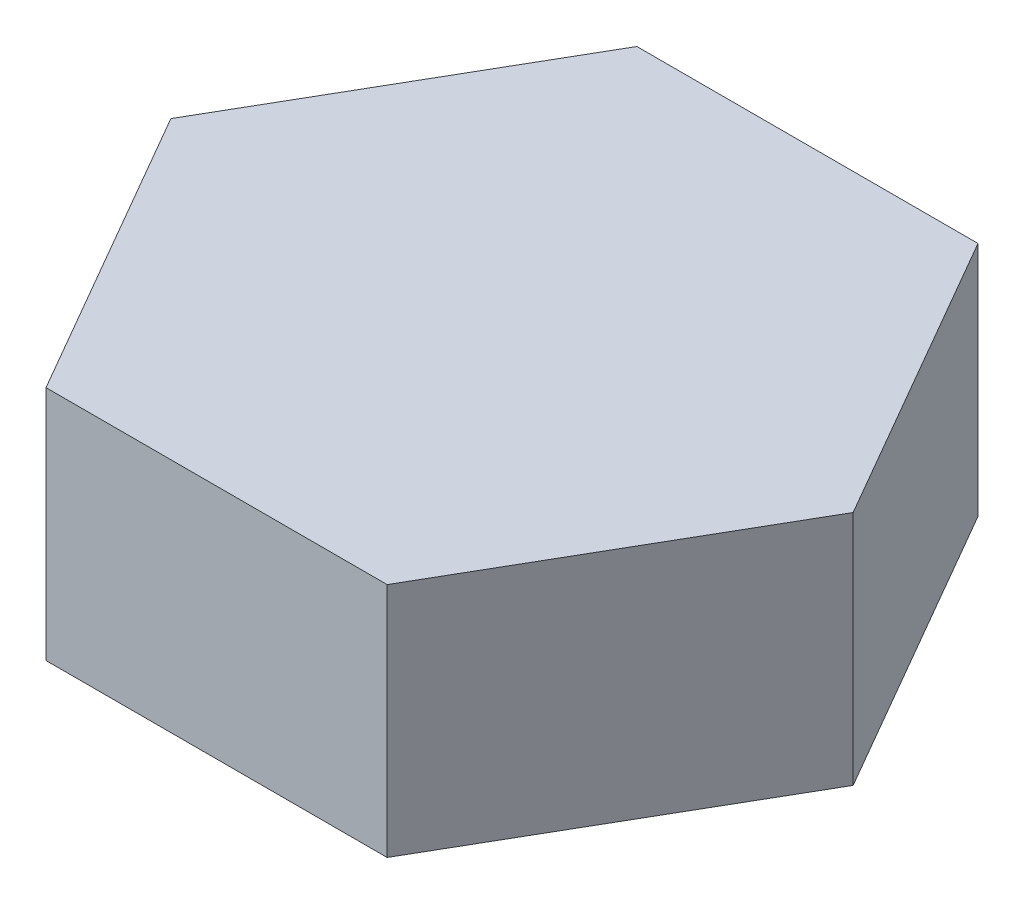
ISO-10303-21;
HEADER;
FILE_DESCRIPTION(('STEP AP214'),'2;1');
FILE_NAME('part.step','',(''),(''),'','','');
FILE_SCHEMA(('AUTOMOTIVE_DESIGN { 1 0 10303 214 1 1 1 1 }'));
ENDSEC;
DATA;
#1=APPLICATION_CONTEXT('core data for automotive mechanical design processes');
#2=APPLICATION_PROTOCOL_DEFINITION('international standard','automotive_design',2000,#1);
#3=PRODUCT_CONTEXT('',#1,'mechanical');
#4=PRODUCT('Part','Part','',(#3));
#5=PRODUCT_RELATED_PRODUCT_CATEGORY('part','',(#4));
#6=PRODUCT_DEFINITION_FORMATION('','',#4);
#7=PRODUCT_DEFINITION_CONTEXT('part definition',#1,'design');
#8=PRODUCT_DEFINITION('design','',#6,#7);
#9=PRODUCT_DEFINITION_SHAPE('','',#8);
#10=(LENGTH_UNIT() NAMED_UNIT(*) SI_UNIT(.MILLI.,.METRE.));
#11=(NAMED_UNIT(*) PLANE_ANGLE_UNIT() SI_UNIT($,.RADIAN.));
#12=(NAMED_UNIT(*) SI_UNIT($,.STERADIAN.) SOLID_ANGLE_UNIT());
#13=UNCERTAINTY_MEASURE_WITH_UNIT(LENGTH_MEASURE(1.E-05),#10,'distance_accuracy_value','');
#14=(GEOMETRIC_REPRESENTATION_CONTEXT(3) GLOBAL_UNCERTAINTY_ASSIGNED_CONTEXT((#13)) GLOBAL_UNIT_ASSIGNED_CONTEXT((#10,
#11,#12)) REPRESENTATION_CONTEXT('',''));
#15=CARTESIAN_POINT('',(0.,0.,0.));
#16=DIRECTION('',(0.,0.,1.));
#17=DIRECTION('',(1.,0.,0.));
#18=AXIS2_PLACEMENT_3D('',#15,#16,#17);
#19=CARTESIAN_POINT('',(28.8675134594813,40.,50.));
#20=DIRECTION('',(-0.866025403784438,0.,-0.5));
#21=DIRECTION('',(-0.5,0.,0.866025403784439));
#22=AXIS2_PLACEMENT_3D('',#19,#20,#21);
#23=PLANE('',#22);
#24=DIRECTION('',(0.5,0.,-0.866025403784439));
#25=VECTOR('',#24,1.);
#26=CARTESIAN_POINT('',(28.8675134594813,0.,50.));
#27=LINE('',#26,#25);
#28=CARTESIAN_POINT('',(28.8675134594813,0.,50.));
#29=VERTEX_POINT('',#28);
#30=CARTESIAN_POINT('',(57.7350269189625,0.,0.));
#31=VERTEX_POINT('',#30);
#32=EDGE_CURVE('E82',#29,#31,#27,.T.);
#33=ORIENTED_EDGE('',*,*,#32,.T.);
#34=DIRECTION('',(0.,-1.,0.));
#35=VECTOR('',#34,1.);
#36=CARTESIAN_POINT('',(57.7350269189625,40.,0.));
#37=LINE('',#36,#35);
#38=CARTESIAN_POINT('',(57.7350269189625,40.,0.));
#39=VERTEX_POINT('',#38);
#40=EDGE_CURVE('E11',#39,#31,#37,.T.);
#41=ORIENTED_EDGE('',*,*,#40,.F.);
#42=DIRECTION('',(0.5,0.,-0.866025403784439));
#43=VECTOR('',#42,1.);
#44=CARTESIAN_POINT('',(28.8675134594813,40.,50.));
#45=LINE('',#44,#43);
#46=CARTESIAN_POINT('',(28.8675134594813,40.,50.));
#47=VERTEX_POINT('',#46);
#48=EDGE_CURVE('E105',#47,#39,#45,.T.);
#49=ORIENTED_EDGE('',*,*,#48,.F.);
#50=DIRECTION('',(0.,-1.,0.));
#51=VECTOR('',#50,1.);
#52=CARTESIAN_POINT('',(28.8675134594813,40.,50.));
#53=LINE('',#52,#51);
#54=EDGE_CURVE('E95',#47,#29,#53,.T.);
#55=ORIENTED_EDGE('',*,*,#54,.T.);
#56=EDGE_LOOP('',(#33,#41,#49,#55));
#57=FACE_BOUND('',#56,.T.);
#58=ADVANCED_FACE('F26',(#57),#23,.F.);
#59=CARTESIAN_POINT('',(57.7350269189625,40.,0.));
#60=DIRECTION('',(-0.866025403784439,0.,0.5));
#61=DIRECTION('',(0.5,0.,0.866025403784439));
#62=AXIS2_PLACEMENT_3D('',#59,#60,#61);
#63=PLANE('',#62);
#64=DIRECTION('',(-0.5,0.,-0.866025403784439));
#65=VECTOR('',#64,1.);
#66=CARTESIAN_POINT('',(57.7350269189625,0.,0.));
#67=LINE('',#66,#65);
#68=CARTESIAN_POINT('',(28.8675134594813,0.,-50.));
#69=VERTEX_POINT('',#68);
#70=EDGE_CURVE('E78',#31,#69,#67,.T.);
#71=ORIENTED_EDGE('',*,*,#70,.T.);
#72=DIRECTION('',(0.,-1.,0.));
#73=VECTOR('',#72,1.);
#74=CARTESIAN_POINT('',(28.8675134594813,40.,-50.));
#75=LINE('',#74,#73);
#76=CARTESIAN_POINT('',(28.8675134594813,40.,-50.));
#77=VERTEX_POINT('',#76);
#78=EDGE_CURVE('E33',#77,#69,#75,.T.);
#79=ORIENTED_EDGE('',*,*,#78,.F.);
#80=DIRECTION('',(-0.5,0.,-0.866025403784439));
#81=VECTOR('',#80,1.);
#82=CARTESIAN_POINT('',(57.7350269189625,40.,0.));
#83=LINE('',#82,#81);
#84=EDGE_CURVE('E91',#39,#77,#83,.T.);
#85=ORIENTED_EDGE('',*,*,#84,.F.);
#86=ORIENTED_EDGE('',*,*,#40,.T.);
#87=EDGE_LOOP('',(#71,#79,#85,#86));
#88=FACE_BOUND('',#87,.T.);
#89=ADVANCED_FACE('F90',(#88),#63,.F.);
#90=CARTESIAN_POINT('',(28.8675134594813,40.,-50.));
#91=DIRECTION('',(0.,0.,1.));
#92=DIRECTION('',(1.,0.,0.));
#93=AXIS2_PLACEMENT_3D('',#90,#91,#92);
#94=PLANE('',#93);
#95=DIRECTION('',(-1.,0.,0.));
#96=VECTOR('',#95,1.);
#97=CARTESIAN_POINT('',(28.8675134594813,0.,-50.));
#98=LINE('',#97,#96);
#99=CARTESIAN_POINT('',(-28.8675134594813,0.,-50.));
#100=VERTEX_POINT('',#99);
#101=EDGE_CURVE('E84',#69,#100,#98,.T.);
#102=ORIENTED_EDGE('',*,*,#101,.T.);
#103=DIRECTION('',(0.,-1.,0.));
#104=VECTOR('',#103,1.);
#105=CARTESIAN_POINT('',(-28.8675134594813,40.,-50.));
#106=LINE('',#105,#104);
#107=CARTESIAN_POINT('',(-28.8675134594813,40.,-50.));
#108=VERTEX_POINT('',#107);
#109=EDGE_CURVE('E121',#108,#100,#106,.T.);
#110=ORIENTED_EDGE('',*,*,#109,.F.);
#111=DIRECTION('',(-1.,0.,0.));
#112=VECTOR('',#111,1.);
#113=CARTESIAN_POINT('',(28.8675134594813,40.,-50.));
#114=LINE('',#113,#112);
#115=EDGE_CURVE('E108',#77,#108,#114,.T.);
#116=ORIENTED_EDGE('',*,*,#115,.F.);
#117=ORIENTED_EDGE('',*,*,#78,.T.);
#118=EDGE_LOOP('',(#102,#110,#116,#117));
#119=FACE_BOUND('',#118,.T.);
#120=ADVANCED_FACE('F125',(#119),#94,.F.);
#121=CARTESIAN_POINT('',(-28.8675134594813,40.,-50.));
#122=DIRECTION('',(0.866025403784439,0.,0.5));
#123=DIRECTION('',(0.5,0.,-0.866025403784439));
#124=AXIS2_PLACEMENT_3D('',#121,#122,#123);
#125=PLANE('',#124);
#126=DIRECTION('',(-0.5,0.,0.866025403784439));
#127=VECTOR('',#126,1.);
#128=CARTESIAN_POINT('',(-28.8675134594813,0.,-50.));
#129=LINE('',#128,#127);
#130=CARTESIAN_POINT('',(-57.7350269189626,0.,0.));
#131=VERTEX_POINT('',#130);
#132=EDGE_CURVE('E99',#100,#131,#129,.T.);
#133=ORIENTED_EDGE('',*,*,#132,.T.);
#134=DIRECTION('',(0.,-1.,0.));
#135=VECTOR('',#134,1.);
#136=CARTESIAN_POINT('',(-57.7350269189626,40.,0.));
#137=LINE('',#136,#135);
#138=CARTESIAN_POINT('',(-57.7350269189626,40.,0.));
#139=VERTEX_POINT('',#138);
#140=EDGE_CURVE('E118',#139,#131,#137,.T.);
#141=ORIENTED_EDGE('',*,*,#140,.F.);
#142=DIRECTION('',(-0.5,0.,0.866025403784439));
#143=VECTOR('',#142,1.);
#144=CARTESIAN_POINT('',(-28.8675134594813,40.,-50.));
#145=LINE('',#144,#143);
#146=EDGE_CURVE('E110',#108,#139,#145,.T.);
#147=ORIENTED_EDGE('',*,*,#146,.F.);
#148=ORIENTED_EDGE('',*,*,#109,.T.);
#149=EDGE_LOOP('',(#133,#141,#147,#148));
#150=FACE_BOUND('',#149,.T.);
#151=ADVANCED_FACE('F131',(#150),#125,.F.);
#152=CARTESIAN_POINT('',(-57.7350269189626,40.,0.));
#153=DIRECTION('',(0.866025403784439,0.,-0.5));
#154=DIRECTION('',(-0.5,0.,-0.866025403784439));
#155=AXIS2_PLACEMENT_3D('',#152,#153,#154);
#156=PLANE('',#155);
#157=DIRECTION('',(0.5,0.,0.866025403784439));
#158=VECTOR('',#157,1.);
#159=CARTESIAN_POINT('',(-57.7350269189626,0.,0.));
#160=LINE('',#159,#158);
#161=CARTESIAN_POINT('',(-28.8675134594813,0.,50.));
#162=VERTEX_POINT('',#161);
#163=EDGE_CURVE('E101',#131,#162,#160,.T.);
#164=ORIENTED_EDGE('',*,*,#163,.T.);
#165=DIRECTION('',(0.,-1.,0.));
#166=VECTOR('',#165,1.);
#167=CARTESIAN_POINT('',(-28.8675134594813,40.,50.));
#168=LINE('',#167,#166);
#169=CARTESIAN_POINT('',(-28.8675134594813,40.,50.));
#170=VERTEX_POINT('',#169);
#171=EDGE_CURVE('E115',#170,#162,#168,.T.);
#172=ORIENTED_EDGE('',*,*,#171,.F.);
#173=DIRECTION('',(0.5,0.,0.866025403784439));
#174=VECTOR('',#173,1.);
#175=CARTESIAN_POINT('',(-57.7350269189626,40.,0.));
#176=LINE('',#175,#174);
#177=EDGE_CURVE('E45',#139,#170,#176,.T.);
#178=ORIENTED_EDGE('',*,*,#177,.F.);
#179=ORIENTED_EDGE('',*,*,#140,.T.);
#180=EDGE_LOOP('',(#164,#172,#178,#179));
#181=FACE_BOUND('',#180,.T.);
#182=ADVANCED_FACE('F134',(#181),#156,.F.);
#183=CARTESIAN_POINT('',(-28.8675134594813,40.,50.));
#184=DIRECTION('',(0.,0.,-1.));
#185=DIRECTION('',(-1.,0.,0.));
#186=AXIS2_PLACEMENT_3D('',#183,#184,#185);
#187=PLANE('',#186);
#188=DIRECTION('',(1.,0.,0.));
#189=VECTOR('',#188,1.);
#190=CARTESIAN_POINT('',(-28.8675134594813,0.,50.));
#191=LINE('',#190,#189);
#192=EDGE_CURVE('E103',#162,#29,#191,.T.);
#193=ORIENTED_EDGE('',*,*,#192,.T.);
#194=ORIENTED_EDGE('',*,*,#54,.F.);
#195=DIRECTION('',(1.,0.,0.));
#196=VECTOR('',#195,1.);
#197=CARTESIAN_POINT('',(-28.8675134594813,40.,50.));
#198=LINE('',#197,#196);
#199=EDGE_CURVE('E40',#170,#47,#198,.T.);
#200=ORIENTED_EDGE('',*,*,#199,.F.);
#201=ORIENTED_EDGE('',*,*,#171,.T.);
#202=EDGE_LOOP('',(#193,#194,#200,#201));
#203=FACE_BOUND('',#202,.T.);
#204=ADVANCED_FACE('F136',(#203),#187,.F.);
#205=CARTESIAN_POINT('',(57.7350269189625,40.,0.));
#206=DIRECTION('',(0.,1.,0.));
#207=DIRECTION('',(0.,0.,1.));
#208=AXIS2_PLACEMENT_3D('',#205,#206,#207);
#209=PLANE('',#208);
#210=ORIENTED_EDGE('',*,*,#48,.T.);
#211=ORIENTED_EDGE('',*,*,#84,.T.);
#212=ORIENTED_EDGE('',*,*,#115,.T.);
#213=ORIENTED_EDGE('',*,*,#146,.T.);
#214=ORIENTED_EDGE('',*,*,#177,.T.);
#215=ORIENTED_EDGE('',*,*,#199,.T.);
#216=EDGE_LOOP('',(#210,#211,#212,#213,#214,#215));
#217=FACE_BOUND('',#216,.T.);
#218=ADVANCED_FACE('F128',(#217),#209,.T.);
#219=CARTESIAN_POINT('',(57.7350269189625,0.,0.));
#220=DIRECTION('',(0.,1.,0.));
#221=DIRECTION('',(0.,0.,1.));
#222=AXIS2_PLACEMENT_3D('',#219,#220,#221);
#223=PLANE('',#222);
#224=ORIENTED_EDGE('',*,*,#32,.F.);
#225=ORIENTED_EDGE('',*,*,#192,.F.);
#226=ORIENTED_EDGE('',*,*,#163,.F.);
#227=ORIENTED_EDGE('',*,*,#132,.F.);
#228=ORIENTED_EDGE('',*,*,#101,.F.);
#229=ORIENTED_EDGE('',*,*,#70,.F.);
#230=EDGE_LOOP('',(#224,#225,#226,#227,#228,#229));
#231=FACE_BOUND('',#230,.T.);
#232=ADVANCED_FACE('F79',(#231),#223,.F.);
#233=CLOSED_SHELL('',(#58,#89,#120,#151,#182,#204,#218,#232));
#234=MANIFOLD_SOLID_BREP('B2',#233);
#235=ADVANCED_BREP_SHAPE_REPRESENTATION('',(#18,#234),#14);
#236=SHAPE_DEFINITION_REPRESENTATION(#9,#235);
ENDSEC;
END-ISO-10303-21;
